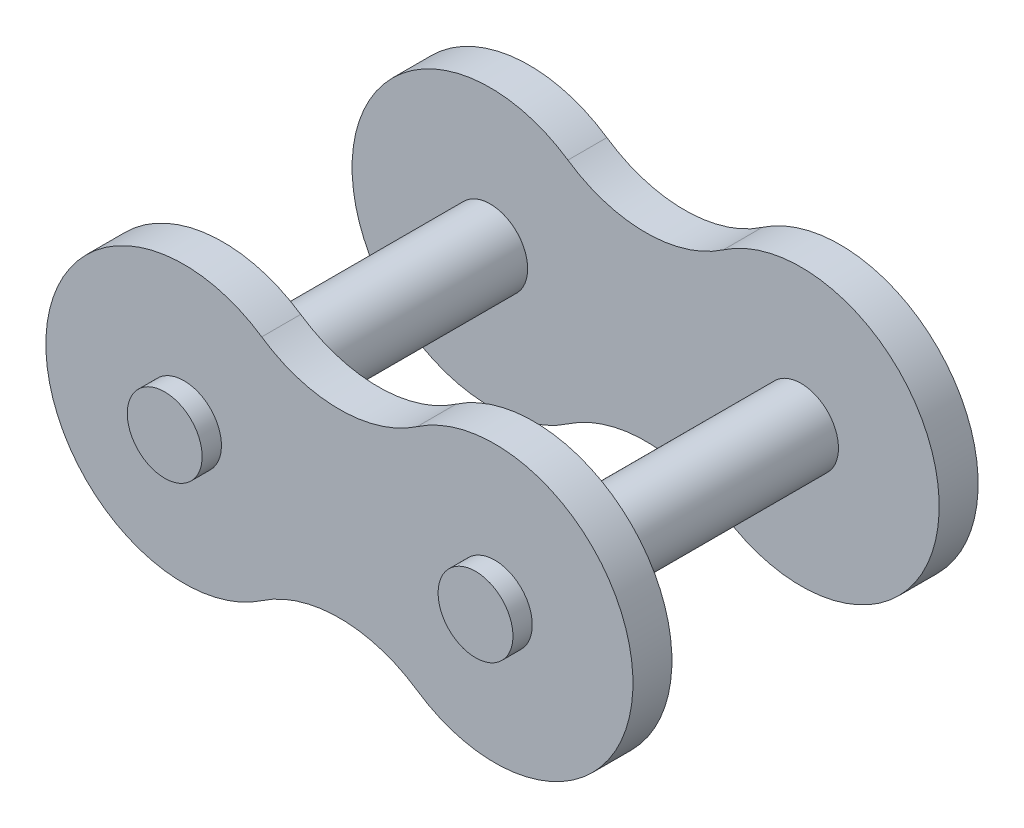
ISO-10303-21;
HEADER;
FILE_DESCRIPTION(('STEP AP214'),'2;1');
FILE_NAME('part.step','',(''),(''),'','','');
FILE_SCHEMA(('AUTOMOTIVE_DESIGN { 1 0 10303 214 1 1 1 1 }'));
ENDSEC;
DATA;
#1=APPLICATION_CONTEXT('core data for automotive mechanical design processes');
#2=APPLICATION_PROTOCOL_DEFINITION('international standard','automotive_design',2000,#1);
#3=PRODUCT_CONTEXT('',#1,'mechanical');
#4=PRODUCT('Part','Part','',(#3));
#5=PRODUCT_RELATED_PRODUCT_CATEGORY('part','',(#4));
#6=PRODUCT_DEFINITION_FORMATION('','',#4);
#7=PRODUCT_DEFINITION_CONTEXT('part definition',#1,'design');
#8=PRODUCT_DEFINITION('design','',#6,#7);
#9=PRODUCT_DEFINITION_SHAPE('','',#8);
#10=(LENGTH_UNIT() NAMED_UNIT(*) SI_UNIT(.MILLI.,.METRE.));
#11=(NAMED_UNIT(*) PLANE_ANGLE_UNIT() SI_UNIT($,.RADIAN.));
#12=(NAMED_UNIT(*) SI_UNIT($,.STERADIAN.) SOLID_ANGLE_UNIT());
#13=UNCERTAINTY_MEASURE_WITH_UNIT(LENGTH_MEASURE(1.E-05),#10,'distance_accuracy_value','');
#14=(GEOMETRIC_REPRESENTATION_CONTEXT(3) GLOBAL_UNCERTAINTY_ASSIGNED_CONTEXT((#13)) GLOBAL_UNIT_ASSIGNED_CONTEXT((#10,
#11,#12)) REPRESENTATION_CONTEXT('',''));
#15=CARTESIAN_POINT('',(0.,0.,0.));
#16=DIRECTION('',(0.,0.,1.));
#17=DIRECTION('',(1.,0.,0.));
#18=AXIS2_PLACEMENT_3D('',#15,#16,#17);
#19=CARTESIAN_POINT('',(0.,0.,6.815));
#20=DIRECTION('',(0.,0.,-1.));
#21=DIRECTION('',(-1.,0.,0.));
#22=AXIS2_PLACEMENT_3D('',#19,#20,#21);
#23=PLANE('',#22);
#24=CARTESIAN_POINT('',(15.88,0.,6.815));
#25=DIRECTION('',(0.,0.,1.));
#26=DIRECTION('',(1.,0.,0.));
#27=AXIS2_PLACEMENT_3D('',#24,#25,#26);
#28=CIRCLE('',#27,1.915);
#29=CARTESIAN_POINT('',(14.9206250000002,-1.6573547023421,6.815));
#30=VERTEX_POINT('',#29);
#31=CARTESIAN_POINT('',(14.9206250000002,1.6573547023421,6.81499999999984));
#32=VERTEX_POINT('',#31);
#33=EDGE_CURVE('E114',#30,#32,#28,.T.);
#34=ORIENTED_EDGE('',*,*,#33,.T.);
#35=CARTESIAN_POINT('',(15.875,0.,6.815));
#36=DIRECTION('',(0.,0.,-1.));
#37=DIRECTION('',(-1.,0.,0.));
#38=AXIS2_PLACEMENT_3D('',#35,#36,#37);
#39=CIRCLE('',#38,1.9125);
#40=EDGE_CURVE('E125',#30,#32,#39,.F.);
#41=ORIENTED_EDGE('',*,*,#40,.F.);
#42=EDGE_LOOP('',(#34,#41));
#43=FACE_BOUND('',#42,.T.);
#44=ADVANCED_FACE('F32',(#43),#23,.F.);
#45=CARTESIAN_POINT('',(15.875,0.,-7.3125));
#46=DIRECTION('',(0.,0.,-1.));
#47=DIRECTION('',(-1.,0.,0.));
#48=AXIS2_PLACEMENT_3D('',#45,#46,#47);
#49=CYLINDRICAL_SURFACE('',#48,1.9125);
#50=CARTESIAN_POINT('',(15.875,0.,-6.815));
#51=DIRECTION('',(0.,0.,-1.));
#52=DIRECTION('',(-1.,0.,0.));
#53=AXIS2_PLACEMENT_3D('',#50,#51,#52);
#54=CIRCLE('',#53,1.9125);
#55=CARTESIAN_POINT('',(14.9206250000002,-1.6573547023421,-6.81499999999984));
#56=VERTEX_POINT('',#55);
#57=CARTESIAN_POINT('',(14.9206250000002,1.6573547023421,-6.81499999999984));
#58=VERTEX_POINT('',#57);
#59=EDGE_CURVE('E41',#56,#58,#54,.F.);
#60=ORIENTED_EDGE('',*,*,#59,.F.);
#61=DIRECTION('',(0.,0.,1.));
#62=VECTOR('',#61,1.);
#63=CARTESIAN_POINT('',(14.9206250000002,-1.6573547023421,-0.00499999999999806));
#64=LINE('',#63,#62);
#65=CARTESIAN_POINT('',(14.9206250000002,-1.6573547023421,-6.8250000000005));
#66=VERTEX_POINT('',#65);
#67=EDGE_CURVE('E57',#56,#66,#64,.F.);
#68=ORIENTED_EDGE('',*,*,#67,.T.);
#69=CARTESIAN_POINT('',(15.875,0.,-6.825));
#70=DIRECTION('',(0.,0.,-1.));
#71=DIRECTION('',(-1.,0.,0.));
#72=AXIS2_PLACEMENT_3D('',#69,#70,#71);
#73=CIRCLE('',#72,1.9125);
#74=CARTESIAN_POINT('',(14.9206250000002,1.6573547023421,-6.8250000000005));
#75=VERTEX_POINT('',#74);
#76=EDGE_CURVE('E185',#66,#75,#73,.F.);
#77=ORIENTED_EDGE('',*,*,#76,.T.);
#78=DIRECTION('',(0.,0.,1.));
#79=VECTOR('',#78,1.);
#80=CARTESIAN_POINT('',(14.9206250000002,1.6573547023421,-0.00499999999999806));
#81=LINE('',#80,#79);
#82=EDGE_CURVE('E119',#75,#58,#81,.T.);
#83=ORIENTED_EDGE('',*,*,#82,.T.);
#84=EDGE_LOOP('',(#60,#68,#77,#83));
#85=FACE_BOUND('',#84,.T.);
#86=ADVANCED_FACE('F174',(#85),#49,.T.);
#87=CARTESIAN_POINT('',(0.,0.,-6.815));
#88=DIRECTION('',(0.,0.,-1.));
#89=DIRECTION('',(-1.,0.,0.));
#90=AXIS2_PLACEMENT_3D('',#87,#88,#89);
#91=PLANE('',#90);
#92=ORIENTED_EDGE('',*,*,#59,.T.);
#93=CARTESIAN_POINT('',(15.88,0.,-6.815));
#94=DIRECTION('',(0.,0.,-1.));
#95=DIRECTION('',(-1.,0.,0.));
#96=AXIS2_PLACEMENT_3D('',#93,#94,#95);
#97=CIRCLE('',#96,1.915);
#98=EDGE_CURVE('E11',#58,#56,#97,.T.);
#99=ORIENTED_EDGE('',*,*,#98,.T.);
#100=EDGE_LOOP('',(#92,#99));
#101=FACE_BOUND('',#100,.T.);
#102=ADVANCED_FACE('F34',(#101),#91,.T.);
#103=CARTESIAN_POINT('',(32.70625,0.,9.8));
#104=DIRECTION('',(0.,0.,1.));
#105=DIRECTION('',(1.,0.,0.));
#106=AXIS2_PLACEMENT_3D('',#103,#104,#105);
#107=PLANE('',#106);
#108=CARTESIAN_POINT('',(31.75,0.,9.8));
#109=DIRECTION('',(0.,0.,-1.));
#110=DIRECTION('',(-1.,0.,0.));
#111=AXIS2_PLACEMENT_3D('',#108,#109,#110);
#112=CIRCLE('',#111,1.9125);
#113=CARTESIAN_POINT('',(29.8375,0.,9.8));
#114=VERTEX_POINT('',#113);
#115=EDGE_CURVE('E126',#114,#114,#112,.T.);
#116=ORIENTED_EDGE('',*,*,#115,.F.);
#117=EDGE_LOOP('',(#116));
#118=FACE_BOUND('',#117,.T.);
#119=ADVANCED_FACE('F297',(#118),#107,.T.);
#120=CARTESIAN_POINT('',(16.83125,0.,9.8));
#121=DIRECTION('',(0.,0.,1.));
#122=DIRECTION('',(1.,0.,0.));
#123=AXIS2_PLACEMENT_3D('',#120,#121,#122);
#124=PLANE('',#123);
#125=CARTESIAN_POINT('',(15.875,0.,9.8));
#126=DIRECTION('',(0.,0.,-1.));
#127=DIRECTION('',(-1.,0.,0.));
#128=AXIS2_PLACEMENT_3D('',#125,#126,#127);
#129=CIRCLE('',#128,1.9125);
#130=CARTESIAN_POINT('',(13.9625,0.,9.8));
#131=VERTEX_POINT('',#130);
#132=EDGE_CURVE('E274',#131,#131,#129,.T.);
#133=ORIENTED_EDGE('',*,*,#132,.F.);
#134=EDGE_LOOP('',(#133));
#135=FACE_BOUND('',#134,.T.);
#136=ADVANCED_FACE('F407',(#135),#124,.T.);
#137=CARTESIAN_POINT('',(31.75,0.,0.));
#138=DIRECTION('',(0.,0.,-1.));
#139=DIRECTION('',(-1.,0.,0.));
#140=AXIS2_PLACEMENT_3D('',#137,#138,#139);
#141=CYLINDRICAL_SURFACE('',#140,1.9125);
#142=CARTESIAN_POINT('',(31.75,0.,8.815));
#143=DIRECTION('',(0.,0.,-1.));
#144=DIRECTION('',(-1.,0.,0.));
#145=AXIS2_PLACEMENT_3D('',#142,#143,#144);
#146=CIRCLE('',#145,1.9125);
#147=CARTESIAN_POINT('',(29.8375,0.,8.815));
#148=VERTEX_POINT('',#147);
#149=EDGE_CURVE('E271',#148,#148,#146,.F.);
#150=ORIENTED_EDGE('',*,*,#149,.T.);
#151=EDGE_LOOP('',(#150));
#152=FACE_BOUND('',#151,.T.);
#153=ORIENTED_EDGE('',*,*,#115,.T.);
#154=EDGE_LOOP('',(#153));
#155=FACE_BOUND('',#154,.T.);
#156=ADVANCED_FACE('F404',(#152,#155),#141,.T.);
#157=CARTESIAN_POINT('',(15.875,0.,7.3125));
#158=DIRECTION('',(0.,0.,-1.));
#159=DIRECTION('',(-1.,0.,0.));
#160=AXIS2_PLACEMENT_3D('',#157,#158,#159);
#161=CYLINDRICAL_SURFACE('',#160,1.9125);
#162=ORIENTED_EDGE('',*,*,#132,.T.);
#163=EDGE_LOOP('',(#162));
#164=FACE_BOUND('',#163,.T.);
#165=CARTESIAN_POINT('',(15.875,0.,8.815));
#166=DIRECTION('',(0.,0.,-1.));
#167=DIRECTION('',(-1.,0.,0.));
#168=AXIS2_PLACEMENT_3D('',#165,#166,#167);
#169=CIRCLE('',#168,1.9125);
#170=CARTESIAN_POINT('',(13.9625,0.,8.815));
#171=VERTEX_POINT('',#170);
#172=EDGE_CURVE('E268',#171,#171,#169,.F.);
#173=ORIENTED_EDGE('',*,*,#172,.T.);
#174=EDGE_LOOP('',(#173));
#175=FACE_BOUND('',#174,.T.);
#176=ADVANCED_FACE('F400',(#164,#175),#161,.T.);
#177=CARTESIAN_POINT('',(0.,0.,8.815));
#178=DIRECTION('',(0.,0.,-1.));
#179=DIRECTION('',(-1.,0.,0.));
#180=AXIS2_PLACEMENT_3D('',#177,#178,#179);
#181=PLANE('',#180);
#182=ORIENTED_EDGE('',*,*,#172,.F.);
#183=EDGE_LOOP('',(#182));
#184=FACE_BOUND('',#183,.T.);
#185=CARTESIAN_POINT('',(15.875,0.,8.815));
#186=DIRECTION('',(0.,0.,-1.));
#187=DIRECTION('',(-1.,0.,0.));
#188=AXIS2_PLACEMENT_3D('',#185,#186,#187);
#189=CIRCLE('',#188,7.0555);
#190=CARTESIAN_POINT('',(19.84375,-5.833446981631,8.815));
#191=VERTEX_POINT('',#190);
#192=CARTESIAN_POINT('',(19.84375,5.833446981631,8.815));
#193=VERTEX_POINT('',#192);
#194=EDGE_CURVE('E266',#191,#193,#189,.T.);
#195=ORIENTED_EDGE('',*,*,#194,.F.);
#196=CARTESIAN_POINT('',(23.8125,-11.666893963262,8.815));
#197=DIRECTION('',(0.,0.,-1.));
#198=DIRECTION('',(-1.,0.,0.));
#199=AXIS2_PLACEMENT_3D('',#196,#197,#198);
#200=CIRCLE('',#199,7.05550000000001);
#201=CARTESIAN_POINT('',(27.78125,-5.833446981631,8.815));
#202=VERTEX_POINT('',#201);
#203=EDGE_CURVE('E254',#191,#202,#200,.T.);
#204=ORIENTED_EDGE('',*,*,#203,.T.);
#205=CARTESIAN_POINT('',(31.75,0.,8.815));
#206=DIRECTION('',(0.,0.,-1.));
#207=DIRECTION('',(-1.,0.,0.));
#208=AXIS2_PLACEMENT_3D('',#205,#206,#207);
#209=CIRCLE('',#208,7.0555);
#210=CARTESIAN_POINT('',(27.78125,5.833446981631,8.815));
#211=VERTEX_POINT('',#210);
#212=EDGE_CURVE('E258',#211,#202,#209,.T.);
#213=ORIENTED_EDGE('',*,*,#212,.F.);
#214=CARTESIAN_POINT('',(23.8125,11.666893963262,8.815));
#215=DIRECTION('',(0.,0.,-1.));
#216=DIRECTION('',(-1.,0.,0.));
#217=AXIS2_PLACEMENT_3D('',#214,#215,#216);
#218=CIRCLE('',#217,7.05550000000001);
#219=EDGE_CURVE('E262',#211,#193,#218,.T.);
#220=ORIENTED_EDGE('',*,*,#219,.T.);
#221=EDGE_LOOP('',(#195,#204,#213,#220));
#222=FACE_BOUND('',#221,.T.);
#223=ORIENTED_EDGE('',*,*,#149,.F.);
#224=EDGE_LOOP('',(#223));
#225=FACE_BOUND('',#224,.T.);
#226=ADVANCED_FACE('F336',(#184,#222,#225),#181,.F.);
#227=CARTESIAN_POINT('',(32.70625,0.,-9.79999999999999));
#228=DIRECTION('',(0.,0.,-1.));
#229=DIRECTION('',(-1.,0.,0.));
#230=AXIS2_PLACEMENT_3D('',#227,#228,#229);
#231=PLANE('',#230);
#232=CARTESIAN_POINT('',(31.75,0.,-9.8));
#233=DIRECTION('',(0.,0.,-1.));
#234=DIRECTION('',(-1.,0.,0.));
#235=AXIS2_PLACEMENT_3D('',#232,#233,#234);
#236=CIRCLE('',#235,1.9125);
#237=CARTESIAN_POINT('',(29.8375,0.,-9.8));
#238=VERTEX_POINT('',#237);
#239=EDGE_CURVE('E251',#238,#238,#236,.F.);
#240=ORIENTED_EDGE('',*,*,#239,.F.);
#241=EDGE_LOOP('',(#240));
#242=FACE_BOUND('',#241,.T.);
#243=ADVANCED_FACE('F389',(#242),#231,.T.);
#244=CARTESIAN_POINT('',(16.83125,0.,-9.8));
#245=DIRECTION('',(0.,0.,-1.));
#246=DIRECTION('',(-1.,0.,0.));
#247=AXIS2_PLACEMENT_3D('',#244,#245,#246);
#248=PLANE('',#247);
#249=CARTESIAN_POINT('',(15.875,0.,-9.8));
#250=DIRECTION('',(0.,0.,-1.));
#251=DIRECTION('',(-1.,0.,0.));
#252=AXIS2_PLACEMENT_3D('',#249,#250,#251);
#253=CIRCLE('',#252,1.9125);
#254=CARTESIAN_POINT('',(13.9625,0.,-9.8));
#255=VERTEX_POINT('',#254);
#256=EDGE_CURVE('E248',#255,#255,#253,.F.);
#257=ORIENTED_EDGE('',*,*,#256,.F.);
#258=EDGE_LOOP('',(#257));
#259=FACE_BOUND('',#258,.T.);
#260=ADVANCED_FACE('F387',(#259),#248,.T.);
#261=CARTESIAN_POINT('',(15.875,0.,6.825));
#262=DIRECTION('',(0.,0.,-1.));
#263=DIRECTION('',(-1.,0.,0.));
#264=AXIS2_PLACEMENT_3D('',#261,#262,#263);
#265=CYLINDRICAL_SURFACE('',#264,7.0555);
#266=DIRECTION('',(0.,0.,-1.));
#267=VECTOR('',#266,1.);
#268=CARTESIAN_POINT('',(19.84375,5.83344698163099,6.825));
#269=LINE('',#268,#267);
#270=CARTESIAN_POINT('',(19.84375,5.83344698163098,6.825));
#271=VERTEX_POINT('',#270);
#272=EDGE_CURVE('E265',#193,#271,#269,.T.);
#273=ORIENTED_EDGE('',*,*,#272,.T.);
#274=CARTESIAN_POINT('',(15.875,0.,6.825));
#275=DIRECTION('',(0.,0.,-1.));
#276=DIRECTION('',(-1.,0.,0.));
#277=AXIS2_PLACEMENT_3D('',#274,#275,#276);
#278=CIRCLE('',#277,7.0555);
#279=CARTESIAN_POINT('',(19.84375,-5.833446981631,6.825));
#280=VERTEX_POINT('',#279);
#281=EDGE_CURVE('E245',#280,#271,#278,.T.);
#282=ORIENTED_EDGE('',*,*,#281,.F.);
#283=DIRECTION('',(0.,0.,-1.));
#284=VECTOR('',#283,1.);
#285=CARTESIAN_POINT('',(19.84375,-5.83344698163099,6.825));
#286=LINE('',#285,#284);
#287=EDGE_CURVE('E257',#280,#191,#286,.F.);
#288=ORIENTED_EDGE('',*,*,#287,.T.);
#289=ORIENTED_EDGE('',*,*,#194,.T.);
#290=EDGE_LOOP('',(#273,#282,#288,#289));
#291=FACE_BOUND('',#290,.T.);
#292=ADVANCED_FACE('F321',(#291),#265,.T.);
#293=CARTESIAN_POINT('',(23.8125,11.666893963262,6.825));
#294=DIRECTION('',(0.,0.,-1.));
#295=DIRECTION('',(-1.,0.,0.));
#296=AXIS2_PLACEMENT_3D('',#293,#294,#295);
#297=CYLINDRICAL_SURFACE('',#296,7.05550000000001);
#298=DIRECTION('',(0.,0.,-1.));
#299=VECTOR('',#298,1.);
#300=CARTESIAN_POINT('',(27.78125,5.83344698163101,6.825));
#301=LINE('',#300,#299);
#302=CARTESIAN_POINT('',(27.78125,5.83344698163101,6.825));
#303=VERTEX_POINT('',#302);
#304=EDGE_CURVE('E261',#303,#211,#301,.F.);
#305=ORIENTED_EDGE('',*,*,#304,.F.);
#306=CARTESIAN_POINT('',(23.8125,11.666893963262,6.825));
#307=DIRECTION('',(0.,0.,-1.));
#308=DIRECTION('',(-1.,0.,0.));
#309=AXIS2_PLACEMENT_3D('',#306,#307,#308);
#310=CIRCLE('',#309,7.05550000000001);
#311=EDGE_CURVE('E242',#271,#303,#310,.F.);
#312=ORIENTED_EDGE('',*,*,#311,.F.);
#313=ORIENTED_EDGE('',*,*,#272,.F.);
#314=ORIENTED_EDGE('',*,*,#219,.F.);
#315=EDGE_LOOP('',(#305,#312,#313,#314));
#316=FACE_BOUND('',#315,.T.);
#317=ADVANCED_FACE('F326',(#316),#297,.F.);
#318=CARTESIAN_POINT('',(31.75,0.,6.825));
#319=DIRECTION('',(0.,0.,-1.));
#320=DIRECTION('',(-1.,0.,0.));
#321=AXIS2_PLACEMENT_3D('',#318,#319,#320);
#322=CYLINDRICAL_SURFACE('',#321,7.0555);
#323=DIRECTION('',(0.,0.,-1.));
#324=VECTOR('',#323,1.);
#325=CARTESIAN_POINT('',(27.78125,-5.83344698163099,6.825));
#326=LINE('',#325,#324);
#327=CARTESIAN_POINT('',(27.78125,-5.83344698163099,6.825));
#328=VERTEX_POINT('',#327);
#329=EDGE_CURVE('E260',#202,#328,#326,.T.);
#330=ORIENTED_EDGE('',*,*,#329,.T.);
#331=CARTESIAN_POINT('',(31.75,0.,6.825));
#332=DIRECTION('',(0.,0.,-1.));
#333=DIRECTION('',(-1.,0.,0.));
#334=AXIS2_PLACEMENT_3D('',#331,#332,#333);
#335=CIRCLE('',#334,7.0555);
#336=EDGE_CURVE('E239',#303,#328,#335,.T.);
#337=ORIENTED_EDGE('',*,*,#336,.F.);
#338=ORIENTED_EDGE('',*,*,#304,.T.);
#339=ORIENTED_EDGE('',*,*,#212,.T.);
#340=EDGE_LOOP('',(#330,#337,#338,#339));
#341=FACE_BOUND('',#340,.T.);
#342=ADVANCED_FACE('F339',(#341),#322,.T.);
#343=CARTESIAN_POINT('',(23.8125,-11.666893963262,6.825));
#344=DIRECTION('',(0.,0.,-1.));
#345=DIRECTION('',(-1.,0.,0.));
#346=AXIS2_PLACEMENT_3D('',#343,#344,#345);
#347=CYLINDRICAL_SURFACE('',#346,7.05550000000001);
#348=ORIENTED_EDGE('',*,*,#287,.F.);
#349=CARTESIAN_POINT('',(23.8125,-11.666893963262,6.825));
#350=DIRECTION('',(0.,0.,-1.));
#351=DIRECTION('',(-1.,0.,0.));
#352=AXIS2_PLACEMENT_3D('',#349,#350,#351);
#353=CIRCLE('',#352,7.05550000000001);
#354=EDGE_CURVE('E236',#328,#280,#353,.F.);
#355=ORIENTED_EDGE('',*,*,#354,.F.);
#356=ORIENTED_EDGE('',*,*,#329,.F.);
#357=ORIENTED_EDGE('',*,*,#203,.F.);
#358=EDGE_LOOP('',(#348,#355,#356,#357));
#359=FACE_BOUND('',#358,.T.);
#360=ADVANCED_FACE('F333',(#359),#347,.F.);
#361=CARTESIAN_POINT('',(31.75,0.,0.));
#362=DIRECTION('',(0.,0.,-1.));
#363=DIRECTION('',(-1.,0.,0.));
#364=AXIS2_PLACEMENT_3D('',#361,#362,#363);
#365=CYLINDRICAL_SURFACE('',#364,1.9125);
#366=ORIENTED_EDGE('',*,*,#239,.T.);
#367=EDGE_LOOP('',(#366));
#368=FACE_BOUND('',#367,.T.);
#369=CARTESIAN_POINT('',(31.75,0.,-8.815));
#370=DIRECTION('',(0.,0.,-1.));
#371=DIRECTION('',(-1.,0.,0.));
#372=AXIS2_PLACEMENT_3D('',#369,#370,#371);
#373=CIRCLE('',#372,1.9125);
#374=CARTESIAN_POINT('',(29.8375,0.,-8.815));
#375=VERTEX_POINT('',#374);
#376=EDGE_CURVE('E233',#375,#375,#373,.F.);
#377=ORIENTED_EDGE('',*,*,#376,.F.);
#378=EDGE_LOOP('',(#377));
#379=FACE_BOUND('',#378,.T.);
#380=ADVANCED_FACE('F346',(#368,#379),#365,.T.);
#381=CARTESIAN_POINT('',(15.875,0.,-7.3125));
#382=DIRECTION('',(0.,0.,-1.));
#383=DIRECTION('',(-1.,0.,0.));
#384=AXIS2_PLACEMENT_3D('',#381,#382,#383);
#385=CYLINDRICAL_SURFACE('',#384,1.9125);
#386=CARTESIAN_POINT('',(15.875,0.,-8.815));
#387=DIRECTION('',(0.,0.,-1.));
#388=DIRECTION('',(-1.,0.,0.));
#389=AXIS2_PLACEMENT_3D('',#386,#387,#388);
#390=CIRCLE('',#389,1.9125);
#391=CARTESIAN_POINT('',(13.9625,0.,-8.815));
#392=VERTEX_POINT('',#391);
#393=EDGE_CURVE('E230',#392,#392,#390,.F.);
#394=ORIENTED_EDGE('',*,*,#393,.F.);
#395=EDGE_LOOP('',(#394));
#396=FACE_BOUND('',#395,.T.);
#397=ORIENTED_EDGE('',*,*,#256,.T.);
#398=EDGE_LOOP('',(#397));
#399=FACE_BOUND('',#398,.T.);
#400=ADVANCED_FACE('F353',(#396,#399),#385,.T.);
#401=CARTESIAN_POINT('',(0.,0.,6.825));
#402=DIRECTION('',(0.,0.,-1.));
#403=DIRECTION('',(-1.,0.,0.));
#404=AXIS2_PLACEMENT_3D('',#401,#402,#403);
#405=PLANE('',#404);
#406=CARTESIAN_POINT('',(15.875,0.,6.825));
#407=DIRECTION('',(0.,0.,-1.));
#408=DIRECTION('',(-1.,0.,0.));
#409=AXIS2_PLACEMENT_3D('',#406,#407,#408);
#410=CIRCLE('',#409,1.9125);
#411=CARTESIAN_POINT('',(13.9625,0.,6.825));
#412=VERTEX_POINT('',#411);
#413=EDGE_CURVE('E227',#412,#412,#410,.T.);
#414=ORIENTED_EDGE('',*,*,#413,.F.);
#415=EDGE_LOOP('',(#414));
#416=FACE_BOUND('',#415,.T.);
#417=ORIENTED_EDGE('',*,*,#336,.T.);
#418=ORIENTED_EDGE('',*,*,#354,.T.);
#419=ORIENTED_EDGE('',*,*,#281,.T.);
#420=ORIENTED_EDGE('',*,*,#311,.T.);
#421=EDGE_LOOP('',(#417,#418,#419,#420));
#422=FACE_BOUND('',#421,.T.);
#423=CARTESIAN_POINT('',(31.75,0.,6.825));
#424=DIRECTION('',(0.,0.,-1.));
#425=DIRECTION('',(-1.,0.,0.));
#426=AXIS2_PLACEMENT_3D('',#423,#424,#425);
#427=CIRCLE('',#426,1.9125);
#428=CARTESIAN_POINT('',(29.8375,0.,6.825));
#429=VERTEX_POINT('',#428);
#430=EDGE_CURVE('E224',#429,#429,#427,.T.);
#431=ORIENTED_EDGE('',*,*,#430,.F.);
#432=EDGE_LOOP('',(#431));
#433=FACE_BOUND('',#432,.T.);
#434=ADVANCED_FACE('F328',(#416,#422,#433),#405,.T.);
#435=CARTESIAN_POINT('',(0.,0.,-8.815));
#436=DIRECTION('',(0.,0.,-1.));
#437=DIRECTION('',(-1.,0.,0.));
#438=AXIS2_PLACEMENT_3D('',#435,#436,#437);
#439=PLANE('',#438);
#440=ORIENTED_EDGE('',*,*,#393,.T.);
#441=EDGE_LOOP('',(#440));
#442=FACE_BOUND('',#441,.T.);
#443=CARTESIAN_POINT('',(23.8125,11.666893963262,-8.815));
#444=DIRECTION('',(0.,0.,1.));
#445=DIRECTION('',(1.,0.,0.));
#446=AXIS2_PLACEMENT_3D('',#443,#444,#445);
#447=CIRCLE('',#446,7.05550000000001);
#448=CARTESIAN_POINT('',(19.84375,5.833446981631,-8.815));
#449=VERTEX_POINT('',#448);
#450=CARTESIAN_POINT('',(27.78125,5.833446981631,-8.815));
#451=VERTEX_POINT('',#450);
#452=EDGE_CURVE('E220',#449,#451,#447,.T.);
#453=ORIENTED_EDGE('',*,*,#452,.T.);
#454=CARTESIAN_POINT('',(31.75,0.,-8.815));
#455=DIRECTION('',(0.,0.,1.));
#456=DIRECTION('',(1.,0.,0.));
#457=AXIS2_PLACEMENT_3D('',#454,#455,#456);
#458=CIRCLE('',#457,7.0555);
#459=CARTESIAN_POINT('',(27.78125,-5.833446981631,-8.815));
#460=VERTEX_POINT('',#459);
#461=EDGE_CURVE('E217',#460,#451,#458,.T.);
#462=ORIENTED_EDGE('',*,*,#461,.F.);
#463=CARTESIAN_POINT('',(23.8125,-11.666893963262,-8.815));
#464=DIRECTION('',(0.,0.,1.));
#465=DIRECTION('',(1.,0.,0.));
#466=AXIS2_PLACEMENT_3D('',#463,#464,#465);
#467=CIRCLE('',#466,7.05550000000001);
#468=CARTESIAN_POINT('',(19.84375,-5.833446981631,-8.815));
#469=VERTEX_POINT('',#468);
#470=EDGE_CURVE('E214',#460,#469,#467,.T.);
#471=ORIENTED_EDGE('',*,*,#470,.T.);
#472=CARTESIAN_POINT('',(15.875,0.,-8.815));
#473=DIRECTION('',(0.,0.,1.));
#474=DIRECTION('',(1.,0.,0.));
#475=AXIS2_PLACEMENT_3D('',#472,#473,#474);
#476=CIRCLE('',#475,7.0555);
#477=EDGE_CURVE('E135',#449,#469,#476,.T.);
#478=ORIENTED_EDGE('',*,*,#477,.F.);
#479=EDGE_LOOP('',(#453,#462,#471,#478));
#480=FACE_BOUND('',#479,.T.);
#481=ORIENTED_EDGE('',*,*,#376,.T.);
#482=EDGE_LOOP('',(#481));
#483=FACE_BOUND('',#482,.T.);
#484=ADVANCED_FACE('F150',(#442,#480,#483),#439,.T.);
#485=CARTESIAN_POINT('',(15.875,0.,7.3125));
#486=DIRECTION('',(0.,0.,-1.));
#487=DIRECTION('',(-1.,0.,0.));
#488=AXIS2_PLACEMENT_3D('',#485,#486,#487);
#489=CYLINDRICAL_SURFACE('',#488,1.9125);
#490=ORIENTED_EDGE('',*,*,#40,.T.);
#491=CARTESIAN_POINT('',(15.875,0.,6.81499999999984));
#492=DIRECTION('',(0.,0.,1.));
#493=DIRECTION('',(-0.499019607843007,0.866590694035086,0.));
#494=AXIS2_PLACEMENT_3D('',#491,#492,#493);
#495=CIRCLE('',#494,1.9125);
#496=EDGE_CURVE('E48',#32,#30,#495,.T.);
#497=ORIENTED_EDGE('',*,*,#496,.T.);
#498=EDGE_LOOP('',(#490,#497));
#499=FACE_BOUND('',#498,.T.);
#500=ORIENTED_EDGE('',*,*,#413,.T.);
#501=EDGE_LOOP('',(#500));
#502=FACE_BOUND('',#501,.T.);
#503=ADVANCED_FACE('F123',(#499,#502),#489,.T.);
#504=CARTESIAN_POINT('',(31.75,0.,0.));
#505=DIRECTION('',(0.,0.,-1.));
#506=DIRECTION('',(-1.,0.,0.));
#507=AXIS2_PLACEMENT_3D('',#504,#505,#506);
#508=CYLINDRICAL_SURFACE('',#507,1.9125);
#509=CARTESIAN_POINT('',(31.75,0.,-6.825));
#510=DIRECTION('',(0.,0.,-1.));
#511=DIRECTION('',(-1.,0.,0.));
#512=AXIS2_PLACEMENT_3D('',#509,#510,#511);
#513=CIRCLE('',#512,1.9125);
#514=CARTESIAN_POINT('',(29.8375,0.,-6.825));
#515=VERTEX_POINT('',#514);
#516=EDGE_CURVE('E129',#515,#515,#513,.F.);
#517=ORIENTED_EDGE('',*,*,#516,.T.);
#518=EDGE_LOOP('',(#517));
#519=FACE_BOUND('',#518,.T.);
#520=ORIENTED_EDGE('',*,*,#430,.T.);
#521=EDGE_LOOP('',(#520));
#522=FACE_BOUND('',#521,.T.);
#523=ADVANCED_FACE('F149',(#519,#522),#508,.T.);
#524=CARTESIAN_POINT('',(23.8125,11.666893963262,-6.825));
#525=DIRECTION('',(0.,0.,1.));
#526=DIRECTION('',(1.,0.,0.));
#527=AXIS2_PLACEMENT_3D('',#524,#525,#526);
#528=CYLINDRICAL_SURFACE('',#527,7.05550000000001);
#529=DIRECTION('',(0.,0.,1.));
#530=VECTOR('',#529,1.);
#531=CARTESIAN_POINT('',(19.84375,5.83344698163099,-6.825));
#532=LINE('',#531,#530);
#533=CARTESIAN_POINT('',(19.84375,5.833446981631,-6.825));
#534=VERTEX_POINT('',#533);
#535=EDGE_CURVE('E223',#534,#449,#532,.F.);
#536=ORIENTED_EDGE('',*,*,#535,.F.);
#537=CARTESIAN_POINT('',(23.8125,11.666893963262,-6.825));
#538=DIRECTION('',(0.,0.,1.));
#539=DIRECTION('',(1.,0.,0.));
#540=AXIS2_PLACEMENT_3D('',#537,#538,#539);
#541=CIRCLE('',#540,7.05550000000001);
#542=CARTESIAN_POINT('',(27.78125,5.833446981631,-6.825));
#543=VERTEX_POINT('',#542);
#544=EDGE_CURVE('E132',#534,#543,#541,.T.);
#545=ORIENTED_EDGE('',*,*,#544,.T.);
#546=DIRECTION('',(0.,0.,1.));
#547=VECTOR('',#546,1.);
#548=CARTESIAN_POINT('',(27.78125,5.83344698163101,-6.825));
#549=LINE('',#548,#547);
#550=EDGE_CURVE('E219',#451,#543,#549,.T.);
#551=ORIENTED_EDGE('',*,*,#550,.F.);
#552=ORIENTED_EDGE('',*,*,#452,.F.);
#553=EDGE_LOOP('',(#536,#545,#551,#552));
#554=FACE_BOUND('',#553,.T.);
#555=ADVANCED_FACE('F154',(#554),#528,.F.);
#556=CARTESIAN_POINT('',(31.75,0.,-6.825));
#557=DIRECTION('',(0.,0.,1.));
#558=DIRECTION('',(1.,0.,0.));
#559=AXIS2_PLACEMENT_3D('',#556,#557,#558);
#560=CYLINDRICAL_SURFACE('',#559,7.0555);
#561=DIRECTION('',(0.,0.,1.));
#562=VECTOR('',#561,1.);
#563=CARTESIAN_POINT('',(27.78125,-5.83344698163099,-6.825));
#564=LINE('',#563,#562);
#565=CARTESIAN_POINT('',(27.78125,-5.833446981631,-6.825));
#566=VERTEX_POINT('',#565);
#567=EDGE_CURVE('E216',#566,#460,#564,.F.);
#568=ORIENTED_EDGE('',*,*,#567,.T.);
#569=ORIENTED_EDGE('',*,*,#461,.T.);
#570=ORIENTED_EDGE('',*,*,#550,.T.);
#571=CARTESIAN_POINT('',(31.75,0.,-6.825));
#572=DIRECTION('',(0.,0.,1.));
#573=DIRECTION('',(1.,0.,0.));
#574=AXIS2_PLACEMENT_3D('',#571,#572,#573);
#575=CIRCLE('',#574,7.0555);
#576=EDGE_CURVE('E206',#543,#566,#575,.F.);
#577=ORIENTED_EDGE('',*,*,#576,.T.);
#578=EDGE_LOOP('',(#568,#569,#570,#577));
#579=FACE_BOUND('',#578,.T.);
#580=ADVANCED_FACE('F158',(#579),#560,.T.);
#581=CARTESIAN_POINT('',(23.8125,-11.666893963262,-6.825));
#582=DIRECTION('',(0.,0.,1.));
#583=DIRECTION('',(1.,0.,0.));
#584=AXIS2_PLACEMENT_3D('',#581,#582,#583);
#585=CYLINDRICAL_SURFACE('',#584,7.05550000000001);
#586=ORIENTED_EDGE('',*,*,#567,.F.);
#587=CARTESIAN_POINT('',(23.8125,-11.666893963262,-6.825));
#588=DIRECTION('',(0.,0.,1.));
#589=DIRECTION('',(1.,0.,0.));
#590=AXIS2_PLACEMENT_3D('',#587,#588,#589);
#591=CIRCLE('',#590,7.05550000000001);
#592=CARTESIAN_POINT('',(19.84375,-5.833446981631,-6.825));
#593=VERTEX_POINT('',#592);
#594=EDGE_CURVE('E201',#566,#593,#591,.T.);
#595=ORIENTED_EDGE('',*,*,#594,.T.);
#596=DIRECTION('',(0.,0.,1.));
#597=VECTOR('',#596,1.);
#598=CARTESIAN_POINT('',(19.84375,-5.83344698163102,-6.825));
#599=LINE('',#598,#597);
#600=EDGE_CURVE('E130',#469,#593,#599,.T.);
#601=ORIENTED_EDGE('',*,*,#600,.F.);
#602=ORIENTED_EDGE('',*,*,#470,.F.);
#603=EDGE_LOOP('',(#586,#595,#601,#602));
#604=FACE_BOUND('',#603,.T.);
#605=ADVANCED_FACE('F162',(#604),#585,.F.);
#606=CARTESIAN_POINT('',(15.875,0.,-6.825));
#607=DIRECTION('',(0.,0.,1.));
#608=DIRECTION('',(1.,0.,0.));
#609=AXIS2_PLACEMENT_3D('',#606,#607,#608);
#610=CYLINDRICAL_SURFACE('',#609,7.0555);
#611=ORIENTED_EDGE('',*,*,#600,.T.);
#612=CARTESIAN_POINT('',(15.875,0.,-6.825));
#613=DIRECTION('',(0.,0.,1.));
#614=DIRECTION('',(1.,0.,0.));
#615=AXIS2_PLACEMENT_3D('',#612,#613,#614);
#616=CIRCLE('',#615,7.0555);
#617=EDGE_CURVE('E199',#593,#534,#616,.F.);
#618=ORIENTED_EDGE('',*,*,#617,.T.);
#619=ORIENTED_EDGE('',*,*,#535,.T.);
#620=ORIENTED_EDGE('',*,*,#477,.T.);
#621=EDGE_LOOP('',(#611,#618,#619,#620));
#622=FACE_BOUND('',#621,.T.);
#623=ADVANCED_FACE('F166',(#622),#610,.T.);
#624=CARTESIAN_POINT('',(0.,0.,-6.825));
#625=DIRECTION('',(0.,0.,-1.));
#626=DIRECTION('',(-1.,0.,0.));
#627=AXIS2_PLACEMENT_3D('',#624,#625,#626);
#628=PLANE('',#627);
#629=ORIENTED_EDGE('',*,*,#576,.F.);
#630=ORIENTED_EDGE('',*,*,#544,.F.);
#631=ORIENTED_EDGE('',*,*,#617,.F.);
#632=ORIENTED_EDGE('',*,*,#594,.F.);
#633=EDGE_LOOP('',(#629,#630,#631,#632));
#634=FACE_BOUND('',#633,.T.);
#635=ORIENTED_EDGE('',*,*,#516,.F.);
#636=EDGE_LOOP('',(#635));
#637=FACE_BOUND('',#636,.T.);
#638=ORIENTED_EDGE('',*,*,#76,.F.);
#639=CARTESIAN_POINT('',(15.88,0.,-6.825));
#640=DIRECTION('',(0.,0.,1.));
#641=DIRECTION('',(-0.500979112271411,0.865459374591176,0.));
#642=AXIS2_PLACEMENT_3D('',#639,#640,#641);
#643=CIRCLE('',#642,1.915);
#644=EDGE_CURVE('E192',#75,#66,#643,.T.);
#645=ORIENTED_EDGE('',*,*,#644,.F.);
#646=EDGE_LOOP('',(#638,#645));
#647=FACE_BOUND('',#646,.T.);
#648=ADVANCED_FACE('F170',(#634,#637,#647),#628,.F.);
#649=CARTESIAN_POINT('',(15.88,0.,-44.6522026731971));
#650=DIRECTION('',(0.,0.,1.));
#651=DIRECTION('',(1.,0.,0.));
#652=AXIS2_PLACEMENT_3D('',#649,#650,#651);
#653=CYLINDRICAL_SURFACE('',#652,1.915);
#654=ORIENTED_EDGE('',*,*,#496,.F.);
#655=ORIENTED_EDGE('',*,*,#33,.F.);
#656=EDGE_LOOP('',(#654,#655));
#657=FACE_BOUND('',#656,.T.);
#658=ORIENTED_EDGE('',*,*,#98,.F.);
#659=ORIENTED_EDGE('',*,*,#82,.F.);
#660=ORIENTED_EDGE('',*,*,#644,.T.);
#661=ORIENTED_EDGE('',*,*,#67,.F.);
#662=EDGE_LOOP('',(#658,#659,#660,#661));
#663=FACE_BOUND('',#662,.T.);
#664=ADVANCED_FACE('F115',(#657,#663),#653,.T.);
#665=CLOSED_SHELL('',(#44,#86,#102,#119,#136,#156,#176,#226,#243,#260,#292,#317,#342,#360,#380,
#400,#434,#484,#503,#523,#555,#580,#605,#623,#648,#664));
#666=MANIFOLD_SOLID_BREP('B2',#665);
#667=ADVANCED_BREP_SHAPE_REPRESENTATION('',(#18,#666),#14);
#668=SHAPE_DEFINITION_REPRESENTATION(#9,#667);
ENDSEC;
END-ISO-10303-21;
